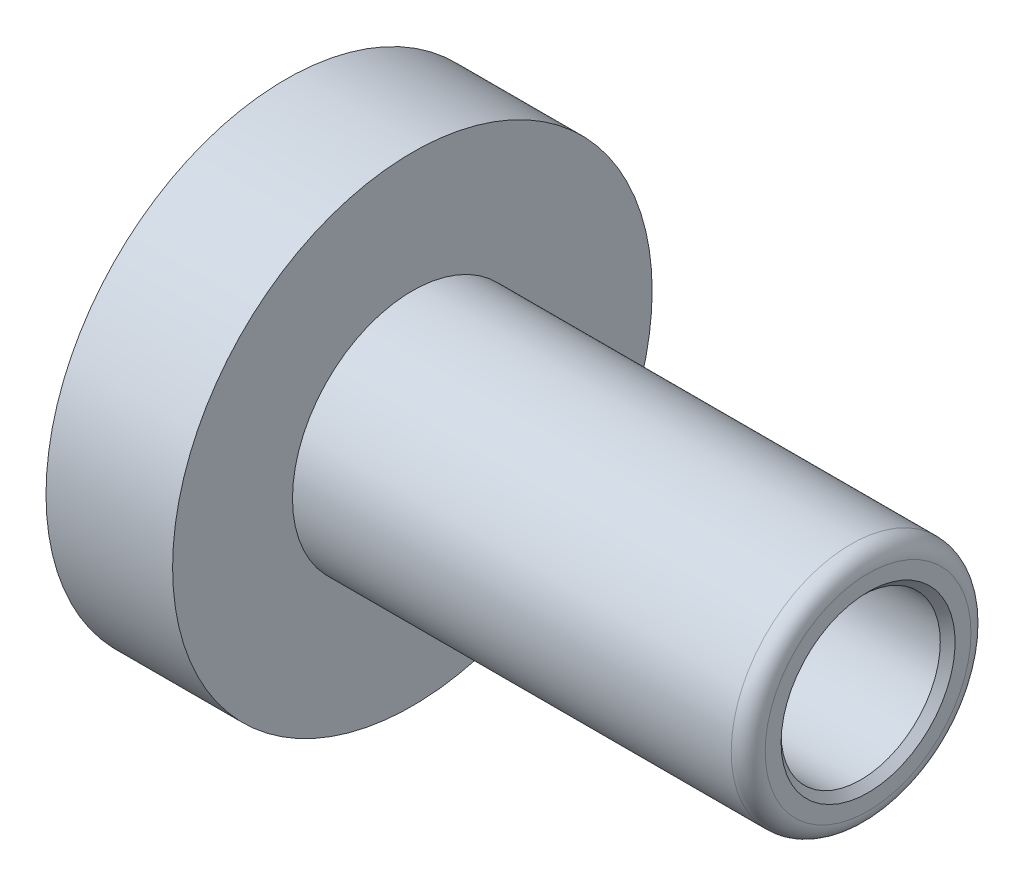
ISO-10303-21;
HEADER;
FILE_DESCRIPTION(('STEP AP214'),'2;1');
FILE_NAME('part.step','',(''),(''),'','','');
FILE_SCHEMA(('AUTOMOTIVE_DESIGN { 1 0 10303 214 1 1 1 1 }'));
ENDSEC;
DATA;
#1=APPLICATION_CONTEXT('core data for automotive mechanical design processes');
#2=APPLICATION_PROTOCOL_DEFINITION('international standard','automotive_design',2000,#1);
#3=PRODUCT_CONTEXT('',#1,'mechanical');
#4=PRODUCT('Part','Part','',(#3));
#5=PRODUCT_RELATED_PRODUCT_CATEGORY('part','',(#4));
#6=PRODUCT_DEFINITION_FORMATION('','',#4);
#7=PRODUCT_DEFINITION_CONTEXT('part definition',#1,'design');
#8=PRODUCT_DEFINITION('design','',#6,#7);
#9=PRODUCT_DEFINITION_SHAPE('','',#8);
#10=(LENGTH_UNIT() NAMED_UNIT(*) SI_UNIT(.MILLI.,.METRE.));
#11=(NAMED_UNIT(*) PLANE_ANGLE_UNIT() SI_UNIT($,.RADIAN.));
#12=(NAMED_UNIT(*) SI_UNIT($,.STERADIAN.) SOLID_ANGLE_UNIT());
#13=UNCERTAINTY_MEASURE_WITH_UNIT(LENGTH_MEASURE(1.E-05),#10,'distance_accuracy_value','');
#14=(GEOMETRIC_REPRESENTATION_CONTEXT(3) GLOBAL_UNCERTAINTY_ASSIGNED_CONTEXT((#13)) GLOBAL_UNIT_ASSIGNED_CONTEXT((#10,
#11,#12)) REPRESENTATION_CONTEXT('',''));
#15=CARTESIAN_POINT('',(0.,0.,0.));
#16=DIRECTION('',(0.,0.,1.));
#17=DIRECTION('',(1.,0.,0.));
#18=AXIS2_PLACEMENT_3D('',#15,#16,#17);
#19=CARTESIAN_POINT('',(0.,0.,0.));
#20=DIRECTION('',(-1.,0.,0.));
#21=DIRECTION('',(0.,0.,1.));
#22=AXIS2_PLACEMENT_3D('',#19,#20,#21);
#23=CYLINDRICAL_SURFACE('',#22,8.128);
#24=CARTESIAN_POINT('',(28.067,0.,0.));
#25=DIRECTION('',(-1.,0.,0.));
#26=DIRECTION('',(0.,0.,1.));
#27=AXIS2_PLACEMENT_3D('',#24,#25,#26);
#28=CIRCLE('',#27,8.128);
#29=CARTESIAN_POINT('',(28.067,0.,8.128));
#30=VERTEX_POINT('',#29);
#31=EDGE_CURVE('E42',#30,#30,#28,.T.);
#32=ORIENTED_EDGE('',*,*,#31,.F.);
#33=EDGE_LOOP('',(#32));
#34=FACE_BOUND('',#33,.T.);
#35=CARTESIAN_POINT('',(0.,0.,0.));
#36=DIRECTION('',(-1.,0.,0.));
#37=DIRECTION('',(0.,0.,1.));
#38=AXIS2_PLACEMENT_3D('',#35,#36,#37);
#39=CIRCLE('',#38,8.128);
#40=CARTESIAN_POINT('',(0.,0.,8.128));
#41=VERTEX_POINT('',#40);
#42=EDGE_CURVE('E63',#41,#41,#39,.T.);
#43=ORIENTED_EDGE('',*,*,#42,.T.);
#44=EDGE_LOOP('',(#43));
#45=FACE_BOUND('',#44,.T.);
#46=ADVANCED_FACE('F31',(#34,#45),#23,.F.);
#47=CARTESIAN_POINT('',(28.067,8.128,0.));
#48=DIRECTION('',(1.,0.,0.));
#49=DIRECTION('',(0.,0.,-1.));
#50=AXIS2_PLACEMENT_3D('',#47,#48,#49);
#51=PLANE('',#50);
#52=ORIENTED_EDGE('',*,*,#31,.T.);
#53=EDGE_LOOP('',(#52));
#54=FACE_BOUND('',#53,.T.);
#55=ADVANCED_FACE('F97',(#54),#51,.F.);
#56=CARTESIAN_POINT('',(53.975,9.5377,0.));
#57=DIRECTION('',(-1.,0.,0.));
#58=DIRECTION('',(0.,0.,1.));
#59=AXIS2_PLACEMENT_3D('',#56,#57,#58);
#60=PLANE('',#59);
#61=CARTESIAN_POINT('',(53.975,0.,0.));
#62=DIRECTION('',(-1.,0.,0.));
#63=DIRECTION('',(0.,0.,1.));
#64=AXIS2_PLACEMENT_3D('',#61,#62,#63);
#65=CIRCLE('',#64,8.0645);
#66=CARTESIAN_POINT('',(53.975,0.,8.0645));
#67=VERTEX_POINT('',#66);
#68=EDGE_CURVE('E10',#67,#67,#65,.T.);
#69=ORIENTED_EDGE('',*,*,#68,.T.);
#70=EDGE_LOOP('',(#69));
#71=FACE_BOUND('',#70,.T.);
#72=CARTESIAN_POINT('',(53.975,0.,0.));
#73=DIRECTION('',(-1.,0.,0.));
#74=DIRECTION('',(0.,0.,1.));
#75=AXIS2_PLACEMENT_3D('',#72,#73,#74);
#76=CIRCLE('',#75,9.5377);
#77=CARTESIAN_POINT('',(53.975,0.,9.5377));
#78=VERTEX_POINT('',#77);
#79=EDGE_CURVE('E46',#78,#78,#76,.T.);
#80=ORIENTED_EDGE('',*,*,#79,.F.);
#81=EDGE_LOOP('',(#80));
#82=FACE_BOUND('',#81,.T.);
#83=ADVANCED_FACE('F102',(#71,#82),#60,.F.);
#84=CARTESIAN_POINT('',(52.4002,0.,0.));
#85=DIRECTION('',(-1.,0.,0.));
#86=DIRECTION('',(0.,0.,1.));
#87=AXIS2_PLACEMENT_3D('',#84,#85,#86);
#88=TOROIDAL_SURFACE('',#87,9.5377,1.5748);
#89=CARTESIAN_POINT('',(52.4002,0.,0.));
#90=DIRECTION('',(-1.,0.,0.));
#91=DIRECTION('',(0.,0.,1.));
#92=AXIS2_PLACEMENT_3D('',#89,#90,#91);
#93=CIRCLE('',#92,11.1125);
#94=CARTESIAN_POINT('',(52.4002,0.,11.1125));
#95=VERTEX_POINT('',#94);
#96=EDGE_CURVE('E51',#95,#95,#93,.T.);
#97=ORIENTED_EDGE('',*,*,#96,.F.);
#98=EDGE_LOOP('',(#97));
#99=FACE_BOUND('',#98,.T.);
#100=ORIENTED_EDGE('',*,*,#79,.T.);
#101=EDGE_LOOP('',(#100));
#102=FACE_BOUND('',#101,.T.);
#103=ADVANCED_FACE('F110',(#99,#102),#88,.T.);
#104=CARTESIAN_POINT('',(0.,0.,0.));
#105=DIRECTION('',(-1.,0.,0.));
#106=DIRECTION('',(0.,0.,1.));
#107=AXIS2_PLACEMENT_3D('',#104,#105,#106);
#108=CYLINDRICAL_SURFACE('',#107,11.1125);
#109=CARTESIAN_POINT('',(11.7348,0.,0.));
#110=DIRECTION('',(-1.,0.,0.));
#111=DIRECTION('',(0.,0.,1.));
#112=AXIS2_PLACEMENT_3D('',#109,#110,#111);
#113=CIRCLE('',#112,11.1125);
#114=CARTESIAN_POINT('',(11.7348,0.,11.1125));
#115=VERTEX_POINT('',#114);
#116=EDGE_CURVE('E54',#115,#115,#113,.T.);
#117=ORIENTED_EDGE('',*,*,#116,.F.);
#118=EDGE_LOOP('',(#117));
#119=FACE_BOUND('',#118,.T.);
#120=ORIENTED_EDGE('',*,*,#96,.T.);
#121=EDGE_LOOP('',(#120));
#122=FACE_BOUND('',#121,.T.);
#123=ADVANCED_FACE('F113',(#119,#122),#108,.T.);
#124=CARTESIAN_POINT('',(11.7348,22.225,0.));
#125=DIRECTION('',(-1.,0.,0.));
#126=DIRECTION('',(0.,0.,1.));
#127=AXIS2_PLACEMENT_3D('',#124,#125,#126);
#128=PLANE('',#127);
#129=CARTESIAN_POINT('',(11.7348,0.,0.));
#130=DIRECTION('',(-1.,0.,0.));
#131=DIRECTION('',(0.,0.,1.));
#132=AXIS2_PLACEMENT_3D('',#129,#130,#131);
#133=CIRCLE('',#132,22.225);
#134=CARTESIAN_POINT('',(11.7348,0.,22.225));
#135=VERTEX_POINT('',#134);
#136=EDGE_CURVE('E57',#135,#135,#133,.T.);
#137=ORIENTED_EDGE('',*,*,#136,.F.);
#138=EDGE_LOOP('',(#137));
#139=FACE_BOUND('',#138,.T.);
#140=ORIENTED_EDGE('',*,*,#116,.T.);
#141=EDGE_LOOP('',(#140));
#142=FACE_BOUND('',#141,.T.);
#143=ADVANCED_FACE('F117',(#139,#142),#128,.F.);
#144=CARTESIAN_POINT('',(0.,0.,0.));
#145=DIRECTION('',(-1.,0.,0.));
#146=DIRECTION('',(0.,0.,1.));
#147=AXIS2_PLACEMENT_3D('',#144,#145,#146);
#148=CYLINDRICAL_SURFACE('',#147,22.225);
#149=CARTESIAN_POINT('',(0.,0.,0.));
#150=DIRECTION('',(-1.,0.,0.));
#151=DIRECTION('',(0.,0.,1.));
#152=AXIS2_PLACEMENT_3D('',#149,#150,#151);
#153=CIRCLE('',#152,22.225);
#154=CARTESIAN_POINT('',(0.,0.,22.225));
#155=VERTEX_POINT('',#154);
#156=EDGE_CURVE('E60',#155,#155,#153,.T.);
#157=ORIENTED_EDGE('',*,*,#156,.F.);
#158=EDGE_LOOP('',(#157));
#159=FACE_BOUND('',#158,.T.);
#160=ORIENTED_EDGE('',*,*,#136,.T.);
#161=EDGE_LOOP('',(#160));
#162=FACE_BOUND('',#161,.T.);
#163=ADVANCED_FACE('F121',(#159,#162),#148,.T.);
#164=CARTESIAN_POINT('',(0.,8.128,0.));
#165=DIRECTION('',(1.,0.,0.));
#166=DIRECTION('',(0.,0.,-1.));
#167=AXIS2_PLACEMENT_3D('',#164,#165,#166);
#168=PLANE('',#167);
#169=CARTESIAN_POINT('',(0.,-12.7,0.));
#170=DIRECTION('',(-1.,0.,0.));
#171=DIRECTION('',(0.,0.,-1.));
#172=AXIS2_PLACEMENT_3D('',#169,#170,#171);
#173=CIRCLE('',#172,3.2004);
#174=CARTESIAN_POINT('',(0.,-12.7,-3.2004));
#175=VERTEX_POINT('',#174);
#176=EDGE_CURVE('E73',#175,#175,#173,.T.);
#177=ORIENTED_EDGE('',*,*,#176,.F.);
#178=EDGE_LOOP('',(#177));
#179=FACE_BOUND('',#178,.T.);
#180=CARTESIAN_POINT('',(0.,12.7,0.));
#181=DIRECTION('',(-1.,0.,0.));
#182=DIRECTION('',(0.,0.,1.));
#183=AXIS2_PLACEMENT_3D('',#180,#181,#182);
#184=CIRCLE('',#183,3.2004);
#185=CARTESIAN_POINT('',(0.,12.7,3.2004));
#186=VERTEX_POINT('',#185);
#187=EDGE_CURVE('E67',#186,#186,#184,.T.);
#188=ORIENTED_EDGE('',*,*,#187,.F.);
#189=EDGE_LOOP('',(#188));
#190=FACE_BOUND('',#189,.T.);
#191=ORIENTED_EDGE('',*,*,#42,.F.);
#192=EDGE_LOOP('',(#191));
#193=FACE_BOUND('',#192,.T.);
#194=ORIENTED_EDGE('',*,*,#156,.T.);
#195=EDGE_LOOP('',(#194));
#196=FACE_BOUND('',#195,.T.);
#197=ADVANCED_FACE('F125',(#179,#190,#193,#196),#168,.F.);
#198=CARTESIAN_POINT('',(7.9502,12.7,0.));
#199=DIRECTION('',(-1.,0.,0.));
#200=DIRECTION('',(0.,0.,1.));
#201=AXIS2_PLACEMENT_3D('',#198,#199,#200);
#202=CYLINDRICAL_SURFACE('',#201,3.2004);
#203=CARTESIAN_POINT('',(7.9502,12.7,0.));
#204=DIRECTION('',(-1.,0.,0.));
#205=DIRECTION('',(0.,0.,1.));
#206=AXIS2_PLACEMENT_3D('',#203,#204,#205);
#207=CIRCLE('',#206,3.2004);
#208=CARTESIAN_POINT('',(7.9502,12.7,3.2004));
#209=VERTEX_POINT('',#208);
#210=EDGE_CURVE('E66',#209,#209,#207,.T.);
#211=ORIENTED_EDGE('',*,*,#210,.F.);
#212=EDGE_LOOP('',(#211));
#213=FACE_BOUND('',#212,.T.);
#214=ORIENTED_EDGE('',*,*,#187,.T.);
#215=EDGE_LOOP('',(#214));
#216=FACE_BOUND('',#215,.T.);
#217=ADVANCED_FACE('F129',(#213,#216),#202,.F.);
#218=CARTESIAN_POINT('',(7.9502,12.7,0.));
#219=DIRECTION('',(-1.,0.,0.));
#220=DIRECTION('',(0.,0.,1.));
#221=AXIS2_PLACEMENT_3D('',#218,#219,#220);
#222=PLANE('',#221);
#223=ORIENTED_EDGE('',*,*,#210,.T.);
#224=EDGE_LOOP('',(#223));
#225=FACE_BOUND('',#224,.T.);
#226=ADVANCED_FACE('F133',(#225),#222,.T.);
#227=CARTESIAN_POINT('',(7.9502,-12.7,0.));
#228=DIRECTION('',(-1.,0.,0.));
#229=DIRECTION('',(0.,0.,1.));
#230=AXIS2_PLACEMENT_3D('',#227,#228,#229);
#231=CYLINDRICAL_SURFACE('',#230,3.2004);
#232=CARTESIAN_POINT('',(7.9502,-12.7,0.));
#233=DIRECTION('',(-1.,0.,0.));
#234=DIRECTION('',(0.,0.,-1.));
#235=AXIS2_PLACEMENT_3D('',#232,#233,#234);
#236=CIRCLE('',#235,3.2004);
#237=CARTESIAN_POINT('',(7.9502,-12.7,-3.2004));
#238=VERTEX_POINT('',#237);
#239=EDGE_CURVE('E70',#238,#238,#236,.T.);
#240=ORIENTED_EDGE('',*,*,#239,.F.);
#241=EDGE_LOOP('',(#240));
#242=FACE_BOUND('',#241,.T.);
#243=ORIENTED_EDGE('',*,*,#176,.T.);
#244=EDGE_LOOP('',(#243));
#245=FACE_BOUND('',#244,.T.);
#246=ADVANCED_FACE('F93',(#242,#245),#231,.F.);
#247=CARTESIAN_POINT('',(7.9502,-12.7,0.));
#248=DIRECTION('',(1.,0.,0.));
#249=DIRECTION('',(0.,0.,-1.));
#250=AXIS2_PLACEMENT_3D('',#247,#248,#249);
#251=PLANE('',#250);
#252=ORIENTED_EDGE('',*,*,#239,.T.);
#253=EDGE_LOOP('',(#252));
#254=FACE_BOUND('',#253,.T.);
#255=ADVANCED_FACE('F86',(#254),#251,.F.);
#256=CARTESIAN_POINT('',(31.1658,0.,0.));
#257=DIRECTION('',(1.,0.,0.));
#258=DIRECTION('',(0.,0.,-1.));
#259=AXIS2_PLACEMENT_3D('',#256,#257,#258);
#260=CYLINDRICAL_SURFACE('',#259,7.3787);
#261=CARTESIAN_POINT('',(53.2892,0.,0.));
#262=DIRECTION('',(-1.,0.,0.));
#263=DIRECTION('',(0.,0.,1.));
#264=AXIS2_PLACEMENT_3D('',#261,#262,#263);
#265=CIRCLE('',#264,7.3787);
#266=CARTESIAN_POINT('',(53.2892,0.,7.3787));
#267=VERTEX_POINT('',#266);
#268=EDGE_CURVE('E38',#267,#267,#265,.F.);
#269=ORIENTED_EDGE('',*,*,#268,.T.);
#270=EDGE_LOOP('',(#269));
#271=FACE_BOUND('',#270,.T.);
#272=CARTESIAN_POINT('',(31.1658,0.,0.));
#273=DIRECTION('',(1.,0.,0.));
#274=DIRECTION('',(0.,0.,-1.));
#275=AXIS2_PLACEMENT_3D('',#272,#273,#274);
#276=CIRCLE('',#275,7.3787);
#277=CARTESIAN_POINT('',(31.1658,0.,-7.3787));
#278=VERTEX_POINT('',#277);
#279=EDGE_CURVE('E76',#278,#278,#276,.T.);
#280=ORIENTED_EDGE('',*,*,#279,.F.);
#281=EDGE_LOOP('',(#280));
#282=FACE_BOUND('',#281,.T.);
#283=ADVANCED_FACE('F84',(#271,#282),#260,.F.);
#284=CARTESIAN_POINT('',(31.1658,0.,0.));
#285=DIRECTION('',(1.,0.,0.));
#286=DIRECTION('',(0.,0.,-1.));
#287=AXIS2_PLACEMENT_3D('',#284,#285,#286);
#288=PLANE('',#287);
#289=ORIENTED_EDGE('',*,*,#279,.T.);
#290=EDGE_LOOP('',(#289));
#291=FACE_BOUND('',#290,.T.);
#292=ADVANCED_FACE('F82',(#291),#288,.T.);
#293=CARTESIAN_POINT('',(53.2892,0.,0.));
#294=DIRECTION('',(1.,0.,0.));
#295=DIRECTION('',(0.,0.,-1.));
#296=AXIS2_PLACEMENT_3D('',#293,#294,#295);
#297=CONICAL_SURFACE('',#296,7.3787,0.785398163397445);
#298=ORIENTED_EDGE('',*,*,#68,.F.);
#299=EDGE_LOOP('',(#298));
#300=FACE_BOUND('',#299,.T.);
#301=ORIENTED_EDGE('',*,*,#268,.F.);
#302=EDGE_LOOP('',(#301));
#303=FACE_BOUND('',#302,.T.);
#304=ADVANCED_FACE('F33',(#300,#303),#297,.F.);
#305=CLOSED_SHELL('',(#46,#55,#83,#103,#123,#143,#163,#197,#217,#226,#246,#255,#283,#292,#304));
#306=MANIFOLD_SOLID_BREP('B2',#305);
#307=ADVANCED_BREP_SHAPE_REPRESENTATION('',(#18,#306),#14);
#308=SHAPE_DEFINITION_REPRESENTATION(#9,#307);
ENDSEC;
END-ISO-10303-21;
